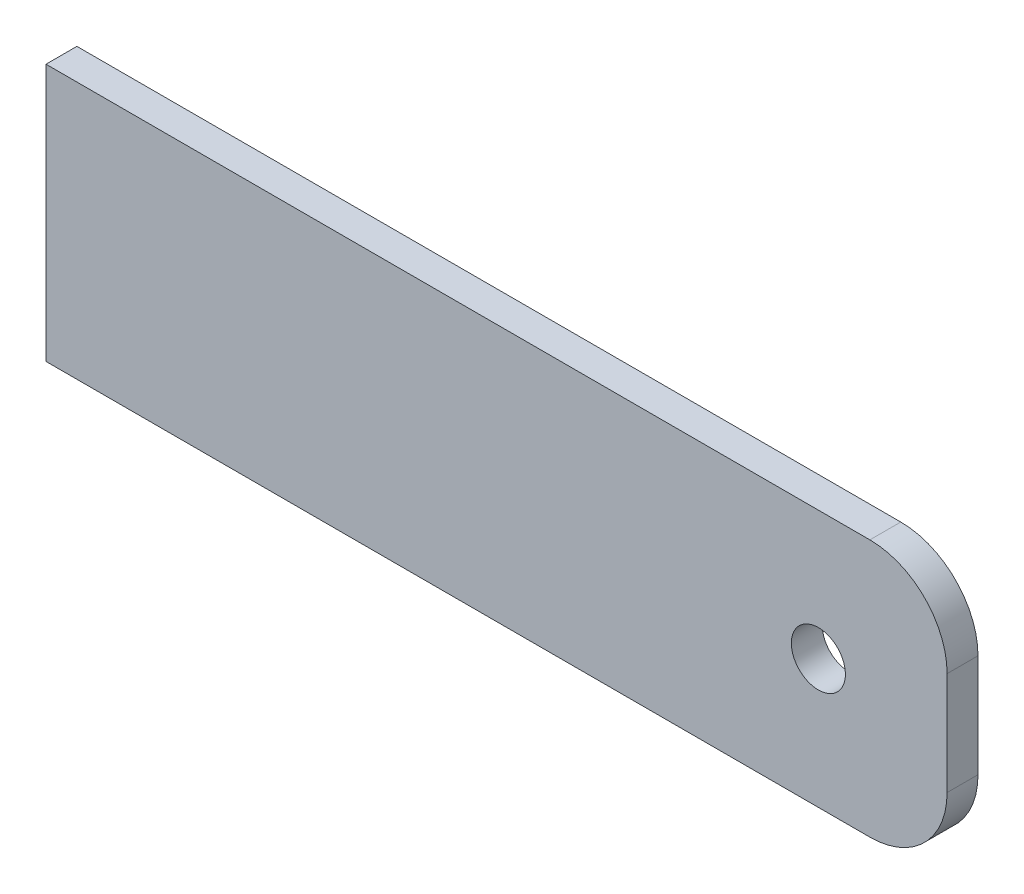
ISO-10303-21;
HEADER;
FILE_DESCRIPTION(('STEP AP214'),'2;1');
FILE_NAME('part.step','',(''),(''),'','','');
FILE_SCHEMA(('AUTOMOTIVE_DESIGN { 1 0 10303 214 1 1 1 1 }'));
ENDSEC;
DATA;
#1=APPLICATION_CONTEXT('core data for automotive mechanical design processes');
#2=APPLICATION_PROTOCOL_DEFINITION('international standard','automotive_design',2000,#1);
#3=PRODUCT_CONTEXT('',#1,'mechanical');
#4=PRODUCT('Part','Part','',(#3));
#5=PRODUCT_RELATED_PRODUCT_CATEGORY('part','',(#4));
#6=PRODUCT_DEFINITION_FORMATION('','',#4);
#7=PRODUCT_DEFINITION_CONTEXT('part definition',#1,'design');
#8=PRODUCT_DEFINITION('design','',#6,#7);
#9=PRODUCT_DEFINITION_SHAPE('','',#8);
#10=(LENGTH_UNIT() NAMED_UNIT(*) SI_UNIT(.MILLI.,.METRE.));
#11=(NAMED_UNIT(*) PLANE_ANGLE_UNIT() SI_UNIT($,.RADIAN.));
#12=(NAMED_UNIT(*) SI_UNIT($,.STERADIAN.) SOLID_ANGLE_UNIT());
#13=UNCERTAINTY_MEASURE_WITH_UNIT(LENGTH_MEASURE(1.E-05),#10,'distance_accuracy_value','');
#14=(GEOMETRIC_REPRESENTATION_CONTEXT(3) GLOBAL_UNCERTAINTY_ASSIGNED_CONTEXT((#13)) GLOBAL_UNIT_ASSIGNED_CONTEXT((#10,
#11,#12)) REPRESENTATION_CONTEXT('',''));
#15=CARTESIAN_POINT('',(0.,0.,0.));
#16=DIRECTION('',(0.,0.,1.));
#17=DIRECTION('',(1.,0.,0.));
#18=AXIS2_PLACEMENT_3D('',#15,#16,#17);
#19=CARTESIAN_POINT('',(320.,-70.,12.));
#20=DIRECTION('',(0.,0.,1.));
#21=DIRECTION('',(1.,0.,0.));
#22=AXIS2_PLACEMENT_3D('',#19,#20,#21);
#23=PLANE('',#22);
#24=DIRECTION('',(0.,-1.,0.));
#25=VECTOR('',#24,1.);
#26=CARTESIAN_POINT('',(0.,0.,12.));
#27=LINE('',#26,#25);
#28=CARTESIAN_POINT('',(0.,0.,12.));
#29=VERTEX_POINT('',#28);
#30=CARTESIAN_POINT('',(0.,-100.,12.));
#31=VERTEX_POINT('',#30);
#32=EDGE_CURVE('E115',#29,#31,#27,.T.);
#33=ORIENTED_EDGE('',*,*,#32,.T.);
#34=DIRECTION('',(1.,0.,0.));
#35=VECTOR('',#34,1.);
#36=CARTESIAN_POINT('',(0.,-100.,12.));
#37=LINE('',#36,#35);
#38=CARTESIAN_POINT('',(320.,-100.,12.));
#39=VERTEX_POINT('',#38);
#40=EDGE_CURVE('E96',#31,#39,#37,.T.);
#41=ORIENTED_EDGE('',*,*,#40,.T.);
#42=CARTESIAN_POINT('',(320.,-70.,12.));
#43=DIRECTION('',(0.,0.,1.));
#44=DIRECTION('',(1.,0.,0.));
#45=AXIS2_PLACEMENT_3D('',#42,#43,#44);
#46=CIRCLE('',#45,30.);
#47=CARTESIAN_POINT('',(350.,-70.,12.));
#48=VERTEX_POINT('',#47);
#49=EDGE_CURVE('E118',#39,#48,#46,.T.);
#50=ORIENTED_EDGE('',*,*,#49,.T.);
#51=DIRECTION('',(0.,1.,0.));
#52=VECTOR('',#51,1.);
#53=CARTESIAN_POINT('',(350.,-30.,12.));
#54=LINE('',#53,#52);
#55=CARTESIAN_POINT('',(350.,-30.,12.));
#56=VERTEX_POINT('',#55);
#57=EDGE_CURVE('E120',#48,#56,#54,.T.);
#58=ORIENTED_EDGE('',*,*,#57,.T.);
#59=CARTESIAN_POINT('',(320.,-30.,12.));
#60=DIRECTION('',(0.,0.,1.));
#61=DIRECTION('',(-1.,0.,0.));
#62=AXIS2_PLACEMENT_3D('',#59,#60,#61);
#63=CIRCLE('',#62,30.);
#64=CARTESIAN_POINT('',(320.,0.,12.));
#65=VERTEX_POINT('',#64);
#66=EDGE_CURVE('E49',#56,#65,#63,.T.);
#67=ORIENTED_EDGE('',*,*,#66,.T.);
#68=DIRECTION('',(-1.,0.,0.));
#69=VECTOR('',#68,1.);
#70=CARTESIAN_POINT('',(0.,0.,12.));
#71=LINE('',#70,#69);
#72=EDGE_CURVE('E44',#65,#29,#71,.T.);
#73=ORIENTED_EDGE('',*,*,#72,.T.);
#74=EDGE_LOOP('',(#33,#41,#50,#58,#67,#73));
#75=FACE_BOUND('',#74,.T.);
#76=CARTESIAN_POINT('',(300.,-50.,12.));
#77=DIRECTION('',(0.,0.,1.));
#78=DIRECTION('',(1.,0.,0.));
#79=AXIS2_PLACEMENT_3D('',#76,#77,#78);
#80=CIRCLE('',#79,10.5);
#81=CARTESIAN_POINT('',(310.5,-50.,12.));
#82=VERTEX_POINT('',#81);
#83=EDGE_CURVE('E101',#82,#82,#80,.T.);
#84=ORIENTED_EDGE('',*,*,#83,.F.);
#85=EDGE_LOOP('',(#84));
#86=FACE_BOUND('',#85,.T.);
#87=ADVANCED_FACE('F29',(#75,#86),#23,.T.);
#88=CARTESIAN_POINT('',(320.,-70.,0.));
#89=DIRECTION('',(0.,0.,1.));
#90=DIRECTION('',(1.,0.,0.));
#91=AXIS2_PLACEMENT_3D('',#88,#89,#90);
#92=PLANE('',#91);
#93=DIRECTION('',(0.,-1.,0.));
#94=VECTOR('',#93,1.);
#95=CARTESIAN_POINT('',(0.,0.,0.));
#96=LINE('',#95,#94);
#97=CARTESIAN_POINT('',(0.,0.,0.));
#98=VERTEX_POINT('',#97);
#99=CARTESIAN_POINT('',(0.,-100.,0.));
#100=VERTEX_POINT('',#99);
#101=EDGE_CURVE('E87',#98,#100,#96,.T.);
#102=ORIENTED_EDGE('',*,*,#101,.F.);
#103=DIRECTION('',(-1.,0.,0.));
#104=VECTOR('',#103,1.);
#105=CARTESIAN_POINT('',(0.,0.,0.));
#106=LINE('',#105,#104);
#107=CARTESIAN_POINT('',(320.,0.,0.));
#108=VERTEX_POINT('',#107);
#109=EDGE_CURVE('E113',#108,#98,#106,.T.);
#110=ORIENTED_EDGE('',*,*,#109,.F.);
#111=CARTESIAN_POINT('',(320.,-30.,0.));
#112=DIRECTION('',(0.,0.,1.));
#113=DIRECTION('',(-1.,0.,0.));
#114=AXIS2_PLACEMENT_3D('',#111,#112,#113);
#115=CIRCLE('',#114,30.);
#116=CARTESIAN_POINT('',(350.,-30.,0.));
#117=VERTEX_POINT('',#116);
#118=EDGE_CURVE('E111',#117,#108,#115,.T.);
#119=ORIENTED_EDGE('',*,*,#118,.F.);
#120=DIRECTION('',(0.,1.,0.));
#121=VECTOR('',#120,1.);
#122=CARTESIAN_POINT('',(350.,-30.,0.));
#123=LINE('',#122,#121);
#124=CARTESIAN_POINT('',(350.,-70.,0.));
#125=VERTEX_POINT('',#124);
#126=EDGE_CURVE('E109',#125,#117,#123,.T.);
#127=ORIENTED_EDGE('',*,*,#126,.F.);
#128=CARTESIAN_POINT('',(320.,-70.,0.));
#129=DIRECTION('',(0.,0.,1.));
#130=DIRECTION('',(1.,0.,0.));
#131=AXIS2_PLACEMENT_3D('',#128,#129,#130);
#132=CIRCLE('',#131,30.);
#133=CARTESIAN_POINT('',(320.,-100.,0.));
#134=VERTEX_POINT('',#133);
#135=EDGE_CURVE('E89',#134,#125,#132,.T.);
#136=ORIENTED_EDGE('',*,*,#135,.F.);
#137=DIRECTION('',(1.,0.,0.));
#138=VECTOR('',#137,1.);
#139=CARTESIAN_POINT('',(0.,-100.,0.));
#140=LINE('',#139,#138);
#141=EDGE_CURVE('E82',#100,#134,#140,.T.);
#142=ORIENTED_EDGE('',*,*,#141,.F.);
#143=EDGE_LOOP('',(#102,#110,#119,#127,#136,#142));
#144=FACE_BOUND('',#143,.T.);
#145=CARTESIAN_POINT('',(300.,-50.,0.));
#146=DIRECTION('',(0.,0.,1.));
#147=DIRECTION('',(1.,0.,0.));
#148=AXIS2_PLACEMENT_3D('',#145,#146,#147);
#149=CIRCLE('',#148,10.5);
#150=CARTESIAN_POINT('',(310.5,-50.,0.));
#151=VERTEX_POINT('',#150);
#152=EDGE_CURVE('E104',#151,#151,#149,.T.);
#153=ORIENTED_EDGE('',*,*,#152,.T.);
#154=EDGE_LOOP('',(#153));
#155=FACE_BOUND('',#154,.T.);
#156=ADVANCED_FACE('F83',(#144,#155),#92,.F.);
#157=CARTESIAN_POINT('',(0.,0.,12.));
#158=DIRECTION('',(1.,0.,0.));
#159=DIRECTION('',(0.,1.,0.));
#160=AXIS2_PLACEMENT_3D('',#157,#158,#159);
#161=PLANE('',#160);
#162=ORIENTED_EDGE('',*,*,#101,.T.);
#163=DIRECTION('',(0.,0.,-1.));
#164=VECTOR('',#163,1.);
#165=CARTESIAN_POINT('',(0.,-100.,12.));
#166=LINE('',#165,#164);
#167=EDGE_CURVE('E11',#31,#100,#166,.T.);
#168=ORIENTED_EDGE('',*,*,#167,.F.);
#169=ORIENTED_EDGE('',*,*,#32,.F.);
#170=DIRECTION('',(0.,0.,-1.));
#171=VECTOR('',#170,1.);
#172=CARTESIAN_POINT('',(0.,0.,12.));
#173=LINE('',#172,#171);
#174=EDGE_CURVE('E100',#29,#98,#173,.T.);
#175=ORIENTED_EDGE('',*,*,#174,.T.);
#176=EDGE_LOOP('',(#162,#168,#169,#175));
#177=FACE_BOUND('',#176,.T.);
#178=ADVANCED_FACE('F31',(#177),#161,.F.);
#179=CARTESIAN_POINT('',(0.,-100.,12.));
#180=DIRECTION('',(0.,1.,0.));
#181=DIRECTION('',(0.,0.,1.));
#182=AXIS2_PLACEMENT_3D('',#179,#180,#181);
#183=PLANE('',#182);
#184=ORIENTED_EDGE('',*,*,#141,.T.);
#185=DIRECTION('',(0.,0.,-1.));
#186=VECTOR('',#185,1.);
#187=CARTESIAN_POINT('',(320.,-100.,12.));
#188=LINE('',#187,#186);
#189=EDGE_CURVE('E37',#39,#134,#188,.T.);
#190=ORIENTED_EDGE('',*,*,#189,.F.);
#191=ORIENTED_EDGE('',*,*,#40,.F.);
#192=ORIENTED_EDGE('',*,*,#167,.T.);
#193=EDGE_LOOP('',(#184,#190,#191,#192));
#194=FACE_BOUND('',#193,.T.);
#195=ADVANCED_FACE('F95',(#194),#183,.F.);
#196=CARTESIAN_POINT('',(320.,-70.,12.));
#197=DIRECTION('',(0.,0.,-1.));
#198=DIRECTION('',(-1.,0.,0.));
#199=AXIS2_PLACEMENT_3D('',#196,#197,#198);
#200=CYLINDRICAL_SURFACE('',#199,30.);
#201=ORIENTED_EDGE('',*,*,#135,.T.);
#202=DIRECTION('',(0.,0.,-1.));
#203=VECTOR('',#202,1.);
#204=CARTESIAN_POINT('',(350.,-70.,12.));
#205=LINE('',#204,#203);
#206=EDGE_CURVE('E131',#48,#125,#205,.T.);
#207=ORIENTED_EDGE('',*,*,#206,.F.);
#208=ORIENTED_EDGE('',*,*,#49,.F.);
#209=ORIENTED_EDGE('',*,*,#189,.T.);
#210=EDGE_LOOP('',(#201,#207,#208,#209));
#211=FACE_BOUND('',#210,.T.);
#212=ADVANCED_FACE('F135',(#211),#200,.T.);
#213=CARTESIAN_POINT('',(350.,-30.,12.));
#214=DIRECTION('',(-1.,0.,0.));
#215=DIRECTION('',(0.,0.,1.));
#216=AXIS2_PLACEMENT_3D('',#213,#214,#215);
#217=PLANE('',#216);
#218=ORIENTED_EDGE('',*,*,#126,.T.);
#219=DIRECTION('',(0.,0.,-1.));
#220=VECTOR('',#219,1.);
#221=CARTESIAN_POINT('',(350.,-30.,12.));
#222=LINE('',#221,#220);
#223=EDGE_CURVE('E128',#56,#117,#222,.T.);
#224=ORIENTED_EDGE('',*,*,#223,.F.);
#225=ORIENTED_EDGE('',*,*,#57,.F.);
#226=ORIENTED_EDGE('',*,*,#206,.T.);
#227=EDGE_LOOP('',(#218,#224,#225,#226));
#228=FACE_BOUND('',#227,.T.);
#229=ADVANCED_FACE('F141',(#228),#217,.F.);
#230=CARTESIAN_POINT('',(320.,-30.,12.));
#231=DIRECTION('',(0.,0.,-1.));
#232=DIRECTION('',(-1.,0.,0.));
#233=AXIS2_PLACEMENT_3D('',#230,#231,#232);
#234=CYLINDRICAL_SURFACE('',#233,30.);
#235=ORIENTED_EDGE('',*,*,#118,.T.);
#236=DIRECTION('',(0.,0.,-1.));
#237=VECTOR('',#236,1.);
#238=CARTESIAN_POINT('',(320.,0.,12.));
#239=LINE('',#238,#237);
#240=EDGE_CURVE('E125',#65,#108,#239,.T.);
#241=ORIENTED_EDGE('',*,*,#240,.F.);
#242=ORIENTED_EDGE('',*,*,#66,.F.);
#243=ORIENTED_EDGE('',*,*,#223,.T.);
#244=EDGE_LOOP('',(#235,#241,#242,#243));
#245=FACE_BOUND('',#244,.T.);
#246=ADVANCED_FACE('F144',(#245),#234,.T.);
#247=CARTESIAN_POINT('',(0.,0.,12.));
#248=DIRECTION('',(0.,-1.,0.));
#249=DIRECTION('',(0.,0.,-1.));
#250=AXIS2_PLACEMENT_3D('',#247,#248,#249);
#251=PLANE('',#250);
#252=ORIENTED_EDGE('',*,*,#109,.T.);
#253=ORIENTED_EDGE('',*,*,#174,.F.);
#254=ORIENTED_EDGE('',*,*,#72,.F.);
#255=ORIENTED_EDGE('',*,*,#240,.T.);
#256=EDGE_LOOP('',(#252,#253,#254,#255));
#257=FACE_BOUND('',#256,.T.);
#258=ADVANCED_FACE('F146',(#257),#251,.F.);
#259=CARTESIAN_POINT('',(300.,-50.,12.));
#260=DIRECTION('',(0.,0.,-1.));
#261=DIRECTION('',(-1.,0.,0.));
#262=AXIS2_PLACEMENT_3D('',#259,#260,#261);
#263=CYLINDRICAL_SURFACE('',#262,10.5);
#264=ORIENTED_EDGE('',*,*,#83,.T.);
#265=EDGE_LOOP('',(#264));
#266=FACE_BOUND('',#265,.T.);
#267=ORIENTED_EDGE('',*,*,#152,.F.);
#268=EDGE_LOOP('',(#267));
#269=FACE_BOUND('',#268,.T.);
#270=ADVANCED_FACE('F148',(#266,#269),#263,.F.);
#271=CLOSED_SHELL('',(#87,#156,#178,#195,#212,#229,#246,#258,#270));
#272=MANIFOLD_SOLID_BREP('B2',#271);
#273=ADVANCED_BREP_SHAPE_REPRESENTATION('',(#18,#272),#14);
#274=SHAPE_DEFINITION_REPRESENTATION(#9,#273);
ENDSEC;
END-ISO-10303-21;
